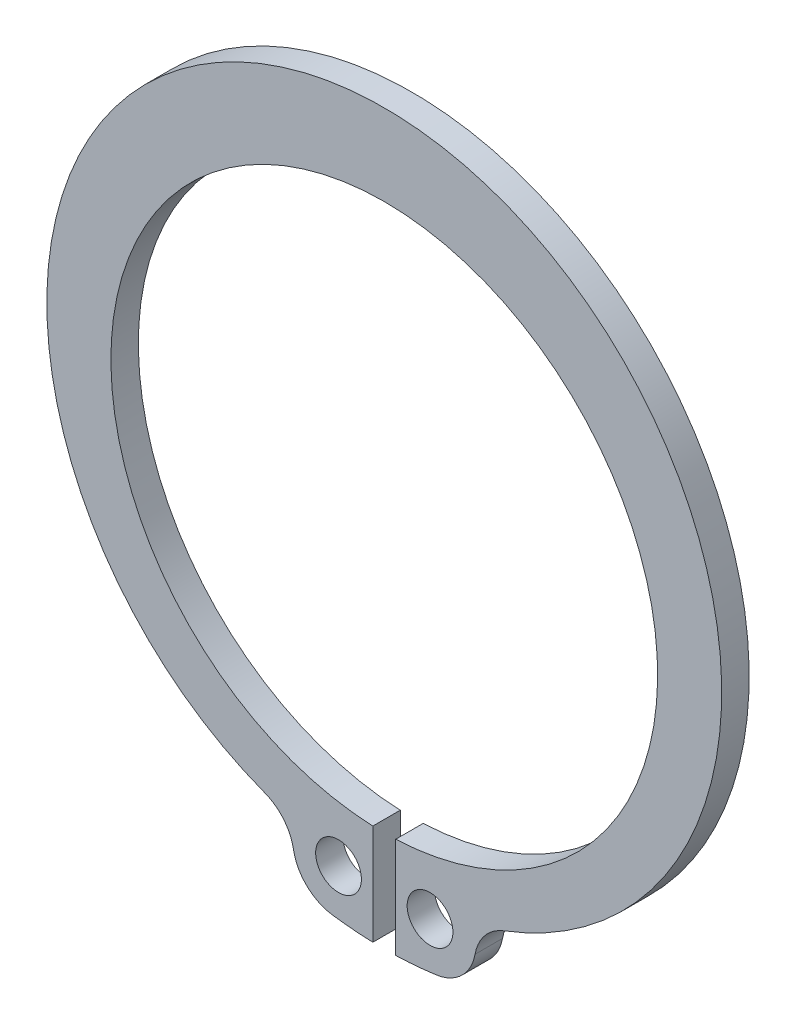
ISO-10303-21;
HEADER;
FILE_DESCRIPTION(('STEP AP214'),'2;1');
FILE_NAME('part.step','',(''),(''),'','','');
FILE_SCHEMA(('AUTOMOTIVE_DESIGN { 1 0 10303 214 1 1 1 1 }'));
ENDSEC;
DATA;
#1=APPLICATION_CONTEXT('core data for automotive mechanical design processes');
#2=APPLICATION_PROTOCOL_DEFINITION('international standard','automotive_design',2000,#1);
#3=PRODUCT_CONTEXT('',#1,'mechanical');
#4=PRODUCT('Part','Part','',(#3));
#5=PRODUCT_RELATED_PRODUCT_CATEGORY('part','',(#4));
#6=PRODUCT_DEFINITION_FORMATION('','',#4);
#7=PRODUCT_DEFINITION_CONTEXT('part definition',#1,'design');
#8=PRODUCT_DEFINITION('design','',#6,#7);
#9=PRODUCT_DEFINITION_SHAPE('','',#8);
#10=(LENGTH_UNIT() NAMED_UNIT(*) SI_UNIT(.MILLI.,.METRE.));
#11=(NAMED_UNIT(*) PLANE_ANGLE_UNIT() SI_UNIT($,.RADIAN.));
#12=(NAMED_UNIT(*) SI_UNIT($,.STERADIAN.) SOLID_ANGLE_UNIT());
#13=UNCERTAINTY_MEASURE_WITH_UNIT(LENGTH_MEASURE(1.E-05),#10,'distance_accuracy_value','');
#14=(GEOMETRIC_REPRESENTATION_CONTEXT(3) GLOBAL_UNCERTAINTY_ASSIGNED_CONTEXT((#13)) GLOBAL_UNIT_ASSIGNED_CONTEXT((#10,
#11,#12)) REPRESENTATION_CONTEXT('',''));
#15=CARTESIAN_POINT('',(0.,0.,0.));
#16=DIRECTION('',(0.,0.,1.));
#17=DIRECTION('',(1.,0.,0.));
#18=AXIS2_PLACEMENT_3D('',#15,#16,#17);
#19=CARTESIAN_POINT('',(0.,-14.1422121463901,1.2));
#20=DIRECTION('',(0.,0.,1.));
#21=DIRECTION('',(1.,0.,0.));
#22=AXIS2_PLACEMENT_3D('',#19,#20,#21);
#23=PLANE('',#22);
#24=CARTESIAN_POINT('',(0.,-11.75,1.2));
#25=DIRECTION('',(0.,0.,1.));
#26=DIRECTION('',(1.,0.,0.));
#27=AXIS2_PLACEMENT_3D('',#24,#25,#26);
#28=CIRCLE('',#27,14.75);
#29=CARTESIAN_POINT('',(-5.22839398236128,-25.5422585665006,1.2));
#30=VERTEX_POINT('',#29);
#31=CARTESIAN_POINT('',(5.22839398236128,-25.5422585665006,1.2));
#32=VERTEX_POINT('',#31);
#33=EDGE_CURVE('E159',#30,#32,#28,.F.);
#34=ORIENTED_EDGE('',*,*,#33,.F.);
#35=CARTESIAN_POINT('',(-5.9373287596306,-27.4123953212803,1.2));
#36=DIRECTION('',(0.,0.,1.));
#37=DIRECTION('',(1.,0.,0.));
#38=AXIS2_PLACEMENT_3D('',#35,#36,#37);
#39=CIRCLE('',#38,2.);
#40=CARTESIAN_POINT('',(-3.9686643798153,-27.0597473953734,1.2));
#41=VERTEX_POINT('',#40);
#42=EDGE_CURVE('E156',#41,#30,#39,.T.);
#43=ORIENTED_EDGE('',*,*,#42,.F.);
#44=CARTESIAN_POINT('',(-2.,-26.7070994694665,1.2));
#45=DIRECTION('',(0.,0.,1.));
#46=DIRECTION('',(1.,0.,0.));
#47=AXIS2_PLACEMENT_3D('',#44,#45,#46);
#48=CIRCLE('',#47,2.);
#49=CARTESIAN_POINT('',(-2.27880036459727,-28.687571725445,1.2));
#50=VERTEX_POINT('',#49);
#51=EDGE_CURVE('E153',#50,#41,#48,.F.);
#52=ORIENTED_EDGE('',*,*,#51,.F.);
#53=CARTESIAN_POINT('',(0.,-12.5,1.2));
#54=DIRECTION('',(0.,0.,1.));
#55=DIRECTION('',(1.,0.,0.));
#56=AXIS2_PLACEMENT_3D('',#53,#54,#55);
#57=CIRCLE('',#56,16.3471835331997);
#58=CARTESIAN_POINT('',(-0.499999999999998,-28.8395351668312,1.2));
#59=VERTEX_POINT('',#58);
#60=EDGE_CURVE('E109',#59,#50,#57,.F.);
#61=ORIENTED_EDGE('',*,*,#60,.F.);
#62=DIRECTION('',(0.,1.,0.));
#63=VECTOR('',#62,1.);
#64=CARTESIAN_POINT('',(-0.499999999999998,-24.4395351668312,1.2));
#65=LINE('',#64,#63);
#66=CARTESIAN_POINT('',(-0.499999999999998,-24.4395351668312,1.2));
#67=VERTEX_POINT('',#66);
#68=EDGE_CURVE('E103',#67,#59,#65,.F.);
#69=ORIENTED_EDGE('',*,*,#68,.F.);
#70=CARTESIAN_POINT('',(0.,-12.5,1.2));
#71=DIRECTION('',(0.,0.,1.));
#72=DIRECTION('',(1.,0.,0.));
#73=AXIS2_PLACEMENT_3D('',#70,#71,#72);
#74=CIRCLE('',#73,11.95);
#75=CARTESIAN_POINT('',(0.499999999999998,-24.4395351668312,1.2));
#76=VERTEX_POINT('',#75);
#77=EDGE_CURVE('E94',#76,#67,#74,.T.);
#78=ORIENTED_EDGE('',*,*,#77,.F.);
#79=DIRECTION('',(0.,-1.,0.));
#80=VECTOR('',#79,1.);
#81=CARTESIAN_POINT('',(0.499999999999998,-28.8395351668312,1.2));
#82=LINE('',#81,#80);
#83=CARTESIAN_POINT('',(0.499999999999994,-28.8395351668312,1.2));
#84=VERTEX_POINT('',#83);
#85=EDGE_CURVE('E89',#84,#76,#82,.F.);
#86=ORIENTED_EDGE('',*,*,#85,.F.);
#87=CARTESIAN_POINT('',(0.,-12.5,1.2));
#88=DIRECTION('',(0.,0.,1.));
#89=DIRECTION('',(1.,0.,0.));
#90=AXIS2_PLACEMENT_3D('',#87,#88,#89);
#91=CIRCLE('',#90,16.3471835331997);
#92=CARTESIAN_POINT('',(2.27880036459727,-28.687571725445,1.2));
#93=VERTEX_POINT('',#92);
#94=EDGE_CURVE('E168',#93,#84,#91,.F.);
#95=ORIENTED_EDGE('',*,*,#94,.F.);
#96=CARTESIAN_POINT('',(2.,-26.7070994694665,1.2));
#97=DIRECTION('',(0.,0.,1.));
#98=DIRECTION('',(1.,0.,0.));
#99=AXIS2_PLACEMENT_3D('',#96,#97,#98);
#100=CIRCLE('',#99,2.);
#101=CARTESIAN_POINT('',(3.9686643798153,-27.0597473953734,1.2));
#102=VERTEX_POINT('',#101);
#103=EDGE_CURVE('E165',#102,#93,#100,.F.);
#104=ORIENTED_EDGE('',*,*,#103,.F.);
#105=CARTESIAN_POINT('',(5.9373287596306,-27.4123953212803,1.2));
#106=DIRECTION('',(0.,0.,1.));
#107=DIRECTION('',(1.,0.,0.));
#108=AXIS2_PLACEMENT_3D('',#105,#106,#107);
#109=CIRCLE('',#108,2.);
#110=EDGE_CURVE('E162',#32,#102,#109,.T.);
#111=ORIENTED_EDGE('',*,*,#110,.F.);
#112=EDGE_LOOP('',(#34,#43,#52,#61,#69,#78,#86,#95,#104,#111));
#113=FACE_BOUND('',#112,.T.);
#114=CARTESIAN_POINT('',(-2.,-26.7070994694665,1.2));
#115=DIRECTION('',(0.,0.,1.));
#116=DIRECTION('',(1.,0.,0.));
#117=AXIS2_PLACEMENT_3D('',#114,#115,#116);
#118=CIRCLE('',#117,1.);
#119=CARTESIAN_POINT('',(-0.999999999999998,-26.7070994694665,1.2));
#120=VERTEX_POINT('',#119);
#121=EDGE_CURVE('E113',#120,#120,#118,.F.);
#122=ORIENTED_EDGE('',*,*,#121,.T.);
#123=EDGE_LOOP('',(#122));
#124=FACE_BOUND('',#123,.T.);
#125=CARTESIAN_POINT('',(2.,-26.7070994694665,1.2));
#126=DIRECTION('',(0.,0.,1.));
#127=DIRECTION('',(1.,0.,0.));
#128=AXIS2_PLACEMENT_3D('',#125,#126,#127);
#129=CIRCLE('',#128,1.);
#130=CARTESIAN_POINT('',(3.,-26.7070994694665,1.2));
#131=VERTEX_POINT('',#130);
#132=EDGE_CURVE('E20',#131,#131,#129,.F.);
#133=ORIENTED_EDGE('',*,*,#132,.T.);
#134=EDGE_LOOP('',(#133));
#135=FACE_BOUND('',#134,.T.);
#136=ADVANCED_FACE('F16',(#113,#124,#135),#23,.T.);
#137=CARTESIAN_POINT('',(2.,-26.7070994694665,0.));
#138=DIRECTION('',(0.,0.,1.));
#139=DIRECTION('',(1.,0.,0.));
#140=AXIS2_PLACEMENT_3D('',#137,#138,#139);
#141=CYLINDRICAL_SURFACE('',#140,1.);
#142=CARTESIAN_POINT('',(2.,-26.7070994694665,0.));
#143=DIRECTION('',(0.,0.,1.));
#144=DIRECTION('',(1.,0.,0.));
#145=AXIS2_PLACEMENT_3D('',#142,#143,#144);
#146=CIRCLE('',#145,1.);
#147=CARTESIAN_POINT('',(3.,-26.7070994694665,0.));
#148=VERTEX_POINT('',#147);
#149=EDGE_CURVE('E147',#148,#148,#146,.F.);
#150=ORIENTED_EDGE('',*,*,#149,.T.);
#151=EDGE_LOOP('',(#150));
#152=FACE_BOUND('',#151,.T.);
#153=ORIENTED_EDGE('',*,*,#132,.F.);
#154=EDGE_LOOP('',(#153));
#155=FACE_BOUND('',#154,.T.);
#156=ADVANCED_FACE('F175',(#152,#155),#141,.F.);
#157=CARTESIAN_POINT('',(-2.,-26.7070994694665,0.));
#158=DIRECTION('',(0.,0.,1.));
#159=DIRECTION('',(1.,0.,0.));
#160=AXIS2_PLACEMENT_3D('',#157,#158,#159);
#161=CYLINDRICAL_SURFACE('',#160,1.);
#162=CARTESIAN_POINT('',(-2.,-26.7070994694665,0.));
#163=DIRECTION('',(0.,0.,1.));
#164=DIRECTION('',(1.,0.,0.));
#165=AXIS2_PLACEMENT_3D('',#162,#163,#164);
#166=CIRCLE('',#165,1.);
#167=CARTESIAN_POINT('',(-0.999999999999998,-26.7070994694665,0.));
#168=VERTEX_POINT('',#167);
#169=EDGE_CURVE('E144',#168,#168,#166,.F.);
#170=ORIENTED_EDGE('',*,*,#169,.T.);
#171=EDGE_LOOP('',(#170));
#172=FACE_BOUND('',#171,.T.);
#173=ORIENTED_EDGE('',*,*,#121,.F.);
#174=EDGE_LOOP('',(#173));
#175=FACE_BOUND('',#174,.T.);
#176=ADVANCED_FACE('F177',(#172,#175),#161,.F.);
#177=CARTESIAN_POINT('',(-0.499999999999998,-24.4395351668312,0.));
#178=DIRECTION('',(1.,0.,0.));
#179=DIRECTION('',(0.,0.,-1.));
#180=AXIS2_PLACEMENT_3D('',#177,#178,#179);
#181=PLANE('',#180);
#182=DIRECTION('',(0.,1.,0.));
#183=VECTOR('',#182,1.);
#184=CARTESIAN_POINT('',(-0.499999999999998,-14.1422121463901,0.));
#185=LINE('',#184,#183);
#186=CARTESIAN_POINT('',(-0.499999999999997,-28.8395351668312,0.));
#187=VERTEX_POINT('',#186);
#188=CARTESIAN_POINT('',(-0.499999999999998,-24.4395351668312,0.));
#189=VERTEX_POINT('',#188);
#190=EDGE_CURVE('E118',#187,#189,#185,.T.);
#191=ORIENTED_EDGE('',*,*,#190,.T.);
#192=DIRECTION('',(0.,0.,1.));
#193=VECTOR('',#192,1.);
#194=CARTESIAN_POINT('',(-0.499999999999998,-24.4395351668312,0.));
#195=LINE('',#194,#193);
#196=EDGE_CURVE('E99',#67,#189,#195,.F.);
#197=ORIENTED_EDGE('',*,*,#196,.F.);
#198=ORIENTED_EDGE('',*,*,#68,.T.);
#199=DIRECTION('',(0.,0.,1.));
#200=VECTOR('',#199,1.);
#201=CARTESIAN_POINT('',(-0.499999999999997,-28.8395351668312,0.));
#202=LINE('',#201,#200);
#203=EDGE_CURVE('E150',#187,#59,#202,.T.);
#204=ORIENTED_EDGE('',*,*,#203,.F.);
#205=EDGE_LOOP('',(#191,#197,#198,#204));
#206=FACE_BOUND('',#205,.T.);
#207=ADVANCED_FACE('F116',(#206),#181,.T.);
#208=CARTESIAN_POINT('',(0.,-12.5,0.));
#209=DIRECTION('',(0.,0.,1.));
#210=DIRECTION('',(1.,0.,0.));
#211=AXIS2_PLACEMENT_3D('',#208,#209,#210);
#212=CYLINDRICAL_SURFACE('',#211,11.95);
#213=CARTESIAN_POINT('',(0.,-12.5,0.));
#214=DIRECTION('',(0.,0.,1.));
#215=DIRECTION('',(1.,0.,0.));
#216=AXIS2_PLACEMENT_3D('',#213,#214,#215);
#217=CIRCLE('',#216,11.95);
#218=CARTESIAN_POINT('',(0.499999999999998,-24.4395351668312,0.));
#219=VERTEX_POINT('',#218);
#220=EDGE_CURVE('E142',#189,#219,#217,.F.);
#221=ORIENTED_EDGE('',*,*,#220,.T.);
#222=DIRECTION('',(0.,0.,1.));
#223=VECTOR('',#222,1.);
#224=CARTESIAN_POINT('',(0.499999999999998,-24.4395351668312,0.));
#225=LINE('',#224,#223);
#226=EDGE_CURVE('E101',#76,#219,#225,.F.);
#227=ORIENTED_EDGE('',*,*,#226,.F.);
#228=ORIENTED_EDGE('',*,*,#77,.T.);
#229=ORIENTED_EDGE('',*,*,#196,.T.);
#230=EDGE_LOOP('',(#221,#227,#228,#229));
#231=FACE_BOUND('',#230,.T.);
#232=ADVANCED_FACE('F97',(#231),#212,.F.);
#233=CARTESIAN_POINT('',(0.499999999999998,-28.8395351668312,0.));
#234=DIRECTION('',(-1.,0.,0.));
#235=DIRECTION('',(0.,-1.,0.));
#236=AXIS2_PLACEMENT_3D('',#233,#234,#235);
#237=PLANE('',#236);
#238=DIRECTION('',(0.,1.,0.));
#239=VECTOR('',#238,1.);
#240=CARTESIAN_POINT('',(0.499999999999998,-14.1422121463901,0.));
#241=LINE('',#240,#239);
#242=CARTESIAN_POINT('',(0.499999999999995,-28.8395351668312,0.));
#243=VERTEX_POINT('',#242);
#244=EDGE_CURVE('E141',#219,#243,#241,.F.);
#245=ORIENTED_EDGE('',*,*,#244,.T.);
#246=DIRECTION('',(0.,0.,1.));
#247=VECTOR('',#246,1.);
#248=CARTESIAN_POINT('',(0.499999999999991,-28.8395351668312,0.));
#249=LINE('',#248,#247);
#250=EDGE_CURVE('E167',#84,#243,#249,.F.);
#251=ORIENTED_EDGE('',*,*,#250,.F.);
#252=ORIENTED_EDGE('',*,*,#85,.T.);
#253=ORIENTED_EDGE('',*,*,#226,.T.);
#254=EDGE_LOOP('',(#245,#251,#252,#253));
#255=FACE_BOUND('',#254,.T.);
#256=ADVANCED_FACE('F223',(#255),#237,.T.);
#257=CARTESIAN_POINT('',(0.,-12.5,0.));
#258=DIRECTION('',(0.,0.,1.));
#259=DIRECTION('',(1.,0.,0.));
#260=AXIS2_PLACEMENT_3D('',#257,#258,#259);
#261=CYLINDRICAL_SURFACE('',#260,16.3471835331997);
#262=CARTESIAN_POINT('',(0.,-12.5,0.));
#263=DIRECTION('',(0.,0.,1.));
#264=DIRECTION('',(1.,0.,0.));
#265=AXIS2_PLACEMENT_3D('',#262,#263,#264);
#266=CIRCLE('',#265,16.3471835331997);
#267=CARTESIAN_POINT('',(2.27880036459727,-28.687571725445,0.));
#268=VERTEX_POINT('',#267);
#269=EDGE_CURVE('E138',#243,#268,#266,.T.);
#270=ORIENTED_EDGE('',*,*,#269,.T.);
#271=DIRECTION('',(0.,0.,1.));
#272=VECTOR('',#271,1.);
#273=CARTESIAN_POINT('',(2.27880036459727,-28.687571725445,0.));
#274=LINE('',#273,#272);
#275=EDGE_CURVE('E164',#93,#268,#274,.F.);
#276=ORIENTED_EDGE('',*,*,#275,.F.);
#277=ORIENTED_EDGE('',*,*,#94,.T.);
#278=ORIENTED_EDGE('',*,*,#250,.T.);
#279=EDGE_LOOP('',(#270,#276,#277,#278));
#280=FACE_BOUND('',#279,.T.);
#281=ADVANCED_FACE('F216',(#280),#261,.T.);
#282=CARTESIAN_POINT('',(2.,-26.7070994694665,0.));
#283=DIRECTION('',(0.,0.,1.));
#284=DIRECTION('',(1.,0.,0.));
#285=AXIS2_PLACEMENT_3D('',#282,#283,#284);
#286=CYLINDRICAL_SURFACE('',#285,2.);
#287=CARTESIAN_POINT('',(2.,-26.7070994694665,0.));
#288=DIRECTION('',(0.,0.,1.));
#289=DIRECTION('',(1.,0.,0.));
#290=AXIS2_PLACEMENT_3D('',#287,#288,#289);
#291=CIRCLE('',#290,2.);
#292=CARTESIAN_POINT('',(3.9686643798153,-27.0597473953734,0.));
#293=VERTEX_POINT('',#292);
#294=EDGE_CURVE('E135',#268,#293,#291,.T.);
#295=ORIENTED_EDGE('',*,*,#294,.T.);
#296=DIRECTION('',(0.,0.,1.));
#297=VECTOR('',#296,1.);
#298=CARTESIAN_POINT('',(3.9686643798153,-27.0597473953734,0.));
#299=LINE('',#298,#297);
#300=EDGE_CURVE('E161',#102,#293,#299,.F.);
#301=ORIENTED_EDGE('',*,*,#300,.F.);
#302=ORIENTED_EDGE('',*,*,#103,.T.);
#303=ORIENTED_EDGE('',*,*,#275,.T.);
#304=EDGE_LOOP('',(#295,#301,#302,#303));
#305=FACE_BOUND('',#304,.T.);
#306=ADVANCED_FACE('F239',(#305),#286,.T.);
#307=CARTESIAN_POINT('',(5.9373287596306,-27.4123953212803,0.));
#308=DIRECTION('',(0.,0.,1.));
#309=DIRECTION('',(1.,0.,0.));
#310=AXIS2_PLACEMENT_3D('',#307,#308,#309);
#311=CYLINDRICAL_SURFACE('',#310,2.);
#312=CARTESIAN_POINT('',(5.9373287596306,-27.4123953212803,0.));
#313=DIRECTION('',(0.,0.,1.));
#314=DIRECTION('',(1.,0.,0.));
#315=AXIS2_PLACEMENT_3D('',#312,#313,#314);
#316=CIRCLE('',#315,2.);
#317=CARTESIAN_POINT('',(5.22839398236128,-25.5422585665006,0.));
#318=VERTEX_POINT('',#317);
#319=EDGE_CURVE('E132',#293,#318,#316,.F.);
#320=ORIENTED_EDGE('',*,*,#319,.T.);
#321=DIRECTION('',(0.,0.,1.));
#322=VECTOR('',#321,1.);
#323=CARTESIAN_POINT('',(5.22839398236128,-25.5422585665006,0.));
#324=LINE('',#323,#322);
#325=EDGE_CURVE('E158',#32,#318,#324,.F.);
#326=ORIENTED_EDGE('',*,*,#325,.F.);
#327=ORIENTED_EDGE('',*,*,#110,.T.);
#328=ORIENTED_EDGE('',*,*,#300,.T.);
#329=EDGE_LOOP('',(#320,#326,#327,#328));
#330=FACE_BOUND('',#329,.T.);
#331=ADVANCED_FACE('F236',(#330),#311,.F.);
#332=CARTESIAN_POINT('',(0.,-11.75,0.));
#333=DIRECTION('',(0.,0.,1.));
#334=DIRECTION('',(1.,0.,0.));
#335=AXIS2_PLACEMENT_3D('',#332,#333,#334);
#336=CYLINDRICAL_SURFACE('',#335,14.75);
#337=CARTESIAN_POINT('',(0.,-11.75,0.));
#338=DIRECTION('',(0.,0.,1.));
#339=DIRECTION('',(1.,0.,0.));
#340=AXIS2_PLACEMENT_3D('',#337,#338,#339);
#341=CIRCLE('',#340,14.75);
#342=CARTESIAN_POINT('',(-5.22839398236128,-25.5422585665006,0.));
#343=VERTEX_POINT('',#342);
#344=EDGE_CURVE('E129',#318,#343,#341,.T.);
#345=ORIENTED_EDGE('',*,*,#344,.T.);
#346=DIRECTION('',(0.,0.,1.));
#347=VECTOR('',#346,1.);
#348=CARTESIAN_POINT('',(-5.22839398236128,-25.5422585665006,0.));
#349=LINE('',#348,#347);
#350=EDGE_CURVE('E155',#30,#343,#349,.F.);
#351=ORIENTED_EDGE('',*,*,#350,.F.);
#352=ORIENTED_EDGE('',*,*,#33,.T.);
#353=ORIENTED_EDGE('',*,*,#325,.T.);
#354=EDGE_LOOP('',(#345,#351,#352,#353));
#355=FACE_BOUND('',#354,.T.);
#356=ADVANCED_FACE('F231',(#355),#336,.T.);
#357=CARTESIAN_POINT('',(-5.9373287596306,-27.4123953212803,0.));
#358=DIRECTION('',(0.,0.,1.));
#359=DIRECTION('',(1.,0.,0.));
#360=AXIS2_PLACEMENT_3D('',#357,#358,#359);
#361=CYLINDRICAL_SURFACE('',#360,2.);
#362=CARTESIAN_POINT('',(-5.9373287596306,-27.4123953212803,0.));
#363=DIRECTION('',(0.,0.,1.));
#364=DIRECTION('',(1.,0.,0.));
#365=AXIS2_PLACEMENT_3D('',#362,#363,#364);
#366=CIRCLE('',#365,2.);
#367=CARTESIAN_POINT('',(-3.9686643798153,-27.0597473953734,0.));
#368=VERTEX_POINT('',#367);
#369=EDGE_CURVE('E126',#343,#368,#366,.F.);
#370=ORIENTED_EDGE('',*,*,#369,.T.);
#371=DIRECTION('',(0.,0.,1.));
#372=VECTOR('',#371,1.);
#373=CARTESIAN_POINT('',(-3.9686643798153,-27.0597473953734,0.));
#374=LINE('',#373,#372);
#375=EDGE_CURVE('E152',#41,#368,#374,.F.);
#376=ORIENTED_EDGE('',*,*,#375,.F.);
#377=ORIENTED_EDGE('',*,*,#42,.T.);
#378=ORIENTED_EDGE('',*,*,#350,.T.);
#379=EDGE_LOOP('',(#370,#376,#377,#378));
#380=FACE_BOUND('',#379,.T.);
#381=ADVANCED_FACE('F204',(#380),#361,.F.);
#382=CARTESIAN_POINT('',(-2.,-26.7070994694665,0.));
#383=DIRECTION('',(0.,0.,1.));
#384=DIRECTION('',(1.,0.,0.));
#385=AXIS2_PLACEMENT_3D('',#382,#383,#384);
#386=CYLINDRICAL_SURFACE('',#385,2.);
#387=CARTESIAN_POINT('',(-2.,-26.7070994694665,0.));
#388=DIRECTION('',(0.,0.,1.));
#389=DIRECTION('',(1.,0.,0.));
#390=AXIS2_PLACEMENT_3D('',#387,#388,#389);
#391=CIRCLE('',#390,2.);
#392=CARTESIAN_POINT('',(-2.27880036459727,-28.687571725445,0.));
#393=VERTEX_POINT('',#392);
#394=EDGE_CURVE('E26',#368,#393,#391,.T.);
#395=ORIENTED_EDGE('',*,*,#394,.T.);
#396=DIRECTION('',(0.,0.,1.));
#397=VECTOR('',#396,1.);
#398=CARTESIAN_POINT('',(-2.27880036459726,-28.687571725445,0.));
#399=LINE('',#398,#397);
#400=EDGE_CURVE('E34',#50,#393,#399,.F.);
#401=ORIENTED_EDGE('',*,*,#400,.F.);
#402=ORIENTED_EDGE('',*,*,#51,.T.);
#403=ORIENTED_EDGE('',*,*,#375,.T.);
#404=EDGE_LOOP('',(#395,#401,#402,#403));
#405=FACE_BOUND('',#404,.T.);
#406=ADVANCED_FACE('F192',(#405),#386,.T.);
#407=CARTESIAN_POINT('',(0.,-12.5,0.));
#408=DIRECTION('',(0.,0.,1.));
#409=DIRECTION('',(1.,0.,0.));
#410=AXIS2_PLACEMENT_3D('',#407,#408,#409);
#411=CYLINDRICAL_SURFACE('',#410,16.3471835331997);
#412=CARTESIAN_POINT('',(0.,-12.5,0.));
#413=DIRECTION('',(0.,0.,1.));
#414=DIRECTION('',(1.,0.,0.));
#415=AXIS2_PLACEMENT_3D('',#412,#413,#414);
#416=CIRCLE('',#415,16.3471835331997);
#417=EDGE_CURVE('E10',#393,#187,#416,.T.);
#418=ORIENTED_EDGE('',*,*,#417,.T.);
#419=ORIENTED_EDGE('',*,*,#203,.T.);
#420=ORIENTED_EDGE('',*,*,#60,.T.);
#421=ORIENTED_EDGE('',*,*,#400,.T.);
#422=EDGE_LOOP('',(#418,#419,#420,#421));
#423=FACE_BOUND('',#422,.T.);
#424=ADVANCED_FACE('F188',(#423),#411,.T.);
#425=CARTESIAN_POINT('',(0.,-14.1422121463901,0.));
#426=DIRECTION('',(0.,0.,1.));
#427=DIRECTION('',(1.,0.,0.));
#428=AXIS2_PLACEMENT_3D('',#425,#426,#427);
#429=PLANE('',#428);
#430=ORIENTED_EDGE('',*,*,#394,.F.);
#431=ORIENTED_EDGE('',*,*,#369,.F.);
#432=ORIENTED_EDGE('',*,*,#344,.F.);
#433=ORIENTED_EDGE('',*,*,#319,.F.);
#434=ORIENTED_EDGE('',*,*,#294,.F.);
#435=ORIENTED_EDGE('',*,*,#269,.F.);
#436=ORIENTED_EDGE('',*,*,#244,.F.);
#437=ORIENTED_EDGE('',*,*,#220,.F.);
#438=ORIENTED_EDGE('',*,*,#190,.F.);
#439=ORIENTED_EDGE('',*,*,#417,.F.);
#440=EDGE_LOOP('',(#430,#431,#432,#433,#434,#435,#436,#437,#438,#439));
#441=FACE_BOUND('',#440,.T.);
#442=ORIENTED_EDGE('',*,*,#169,.F.);
#443=EDGE_LOOP('',(#442));
#444=FACE_BOUND('',#443,.T.);
#445=ORIENTED_EDGE('',*,*,#149,.F.);
#446=EDGE_LOOP('',(#445));
#447=FACE_BOUND('',#446,.T.);
#448=ADVANCED_FACE('F18',(#441,#444,#447),#429,.F.);
#449=CLOSED_SHELL('',(#136,#156,#176,#207,#232,#256,#281,#306,#331,#356,#381,#406,#424,#448));
#450=MANIFOLD_SOLID_BREP('B1',#449);
#451=ADVANCED_BREP_SHAPE_REPRESENTATION('',(#18,#450),#14);
#452=SHAPE_DEFINITION_REPRESENTATION(#9,#451);
ENDSEC;
END-ISO-10303-21;
